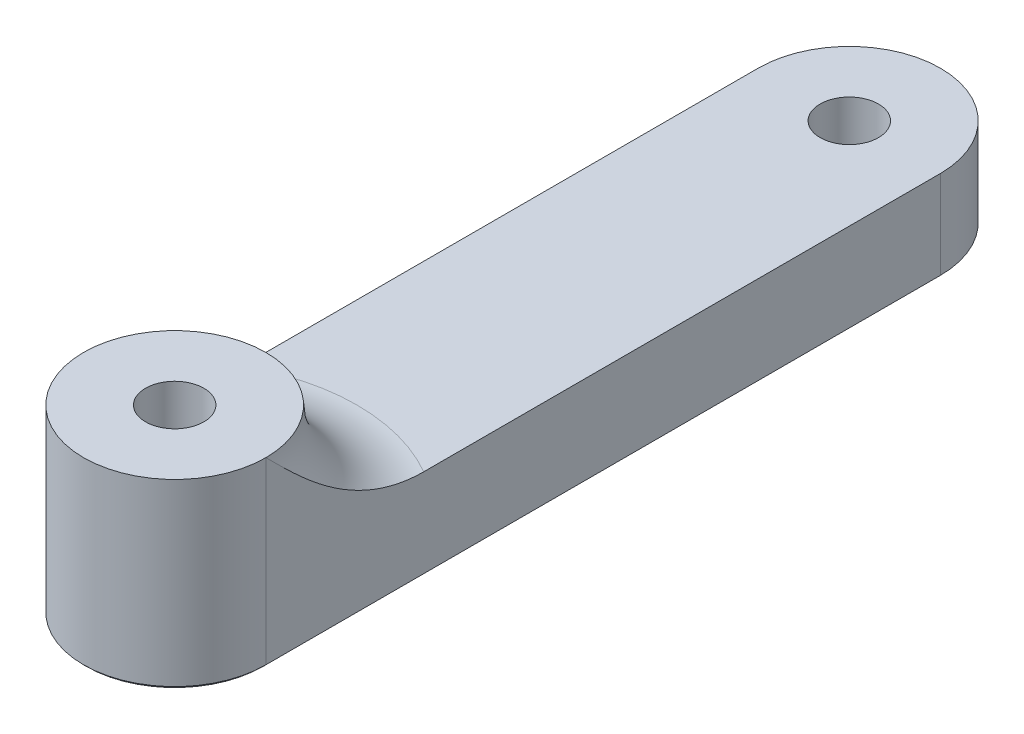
ISO-10303-21;
HEADER;
FILE_DESCRIPTION(('STEP AP214'),'2;1');
FILE_NAME('part.step','',(''),(''),'','','');
FILE_SCHEMA(('AUTOMOTIVE_DESIGN { 1 0 10303 214 1 1 1 1 }'));
ENDSEC;
DATA;
#1=APPLICATION_CONTEXT('core data for automotive mechanical design processes');
#2=APPLICATION_PROTOCOL_DEFINITION('international standard','automotive_design',2000,#1);
#3=PRODUCT_CONTEXT('',#1,'mechanical');
#4=PRODUCT('Part','Part','',(#3));
#5=PRODUCT_RELATED_PRODUCT_CATEGORY('part','',(#4));
#6=PRODUCT_DEFINITION_FORMATION('','',#4);
#7=PRODUCT_DEFINITION_CONTEXT('part definition',#1,'design');
#8=PRODUCT_DEFINITION('design','',#6,#7);
#9=PRODUCT_DEFINITION_SHAPE('','',#8);
#10=(LENGTH_UNIT() NAMED_UNIT(*) SI_UNIT(.MILLI.,.METRE.));
#11=(NAMED_UNIT(*) PLANE_ANGLE_UNIT() SI_UNIT($,.RADIAN.));
#12=(NAMED_UNIT(*) SI_UNIT($,.STERADIAN.) SOLID_ANGLE_UNIT());
#13=UNCERTAINTY_MEASURE_WITH_UNIT(LENGTH_MEASURE(1.E-05),#10,'distance_accuracy_value','');
#14=(GEOMETRIC_REPRESENTATION_CONTEXT(3) GLOBAL_UNCERTAINTY_ASSIGNED_CONTEXT((#13)) GLOBAL_UNIT_ASSIGNED_CONTEXT((#10,
#11,#12)) REPRESENTATION_CONTEXT('',''));
#15=CARTESIAN_POINT('',(0.,0.,0.));
#16=DIRECTION('',(0.,0.,1.));
#17=DIRECTION('',(1.,0.,0.));
#18=AXIS2_PLACEMENT_3D('',#15,#16,#17);
#19=CARTESIAN_POINT('',(5.,5.,0.));
#20=DIRECTION('',(-1.,0.,0.));
#21=DIRECTION('',(0.,0.,1.));
#22=AXIS2_PLACEMENT_3D('',#19,#20,#21);
#23=PLANE('',#22);
#24=DIRECTION('',(0.,-1.,0.));
#25=VECTOR('',#24,1.);
#26=CARTESIAN_POINT('',(5.,5.,0.));
#27=LINE('',#26,#25);
#28=CARTESIAN_POINT('',(5.,10.,0.));
#29=VERTEX_POINT('',#28);
#30=CARTESIAN_POINT('',(5.,0.16,0.));
#31=VERTEX_POINT('',#30);
#32=EDGE_CURVE('E136',#29,#31,#27,.T.);
#33=ORIENTED_EDGE('',*,*,#32,.T.);
#34=DIRECTION('',(0.,0.,-1.));
#35=VECTOR('',#34,1.);
#36=CARTESIAN_POINT('',(5.,0.16,0.));
#37=LINE('',#36,#35);
#38=CARTESIAN_POINT('',(5.,0.16,-37.));
#39=VERTEX_POINT('',#38);
#40=EDGE_CURVE('E134',#31,#39,#37,.T.);
#41=ORIENTED_EDGE('',*,*,#40,.T.);
#42=DIRECTION('',(0.,-1.,0.));
#43=VECTOR('',#42,1.);
#44=CARTESIAN_POINT('',(5.,5.,-37.));
#45=LINE('',#44,#43);
#46=CARTESIAN_POINT('',(5.,5.,-37.));
#47=VERTEX_POINT('',#46);
#48=EDGE_CURVE('E125',#47,#39,#45,.T.);
#49=ORIENTED_EDGE('',*,*,#48,.F.);
#50=DIRECTION('',(0.,0.,-1.));
#51=VECTOR('',#50,1.);
#52=CARTESIAN_POINT('',(5.,5.,0.));
#53=LINE('',#52,#51);
#54=CARTESIAN_POINT('',(5.,5.,-8.66025403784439));
#55=VERTEX_POINT('',#54);
#56=EDGE_CURVE('E110',#55,#47,#53,.T.);
#57=ORIENTED_EDGE('',*,*,#56,.F.);
#58=CARTESIAN_POINT('',(5.,5.,-8.66025403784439));
#59=CARTESIAN_POINT('',(5.,4.99997030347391,-8.44601573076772));
#60=CARTESIAN_POINT('',(5.,5.01032231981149,-8.23190253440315));
#61=CARTESIAN_POINT('',(5.,5.050367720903,-7.80580224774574));
#62=CARTESIAN_POINT('',(5.,5.08003167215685,-7.59381241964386));
#63=CARTESIAN_POINT('',(5.,5.15682193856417,-7.1757075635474));
#64=CARTESIAN_POINT('',(5.,5.20373357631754,-6.96955252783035));
#65=CARTESIAN_POINT('',(5.,5.31359736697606,-6.56149704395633));
#66=CARTESIAN_POINT('',(5.,5.37655718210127,-6.35959867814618));
#67=CARTESIAN_POINT('',(5.,5.54314037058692,-5.88676408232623));
#68=CARTESIAN_POINT('',(5.,5.65317829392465,-5.61808083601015));
#69=CARTESIAN_POINT('',(5.,5.89668641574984,-5.09159904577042));
#70=CARTESIAN_POINT('',(5.,6.03016371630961,-4.83380383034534));
#71=CARTESIAN_POINT('',(5.,6.31742397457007,-4.32824469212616));
#72=CARTESIAN_POINT('',(5.,6.47130085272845,-4.08053454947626));
#73=CARTESIAN_POINT('',(5.,6.7953125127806,-3.59591179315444));
#74=CARTESIAN_POINT('',(5.,6.96545472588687,-3.3590041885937));
#75=CARTESIAN_POINT('',(5.,7.56870777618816,-2.56650316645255));
#76=CARTESIAN_POINT('',(5.,8.03294068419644,-2.0348194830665));
#77=CARTESIAN_POINT('',(5.,8.99476039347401,-1.00542089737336));
#78=CARTESIAN_POINT('',(5.,9.49232114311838,-0.507680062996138));
#79=CARTESIAN_POINT('',(5.,9.99333333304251,-0.00666666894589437));
#80=CARTESIAN_POINT('',(5.,9.99666666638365,-0.00333333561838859));
#81=CARTESIAN_POINT('',(5.,10.,0.));
#82=B_SPLINE_CURVE_WITH_KNOTS('',3,(#58,#59,#60,#61,#62,#63,#64,#65,#66,#67,#68,#69,#70,#71,#72,
#73,#74,#75,#76,#77,#78,#79,#80,#81),.UNSPECIFIED.,.F.,.F.,(4,2,2,2,2,2,2,2,2,2,2,4),(0.,
0.642281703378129,1.28358678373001,1.91716595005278,2.55104818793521,3.42069998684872,
4.29061574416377,5.16468554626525,6.03915661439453,8.15226547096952,10.2637414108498,
10.2778835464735),.UNSPECIFIED.);
#83=EDGE_CURVE('E11',#55,#29,#82,.T.);
#84=ORIENTED_EDGE('',*,*,#83,.T.);
#85=EDGE_LOOP('',(#33,#41,#49,#57,#84));
#86=FACE_BOUND('',#85,.T.);
#87=ADVANCED_FACE('F47',(#86),#23,.F.);
#88=CARTESIAN_POINT('',(0.,5.,-37.));
#89=DIRECTION('',(0.,-1.,0.));
#90=DIRECTION('',(0.,0.,-1.));
#91=AXIS2_PLACEMENT_3D('',#88,#89,#90);
#92=CYLINDRICAL_SURFACE('',#91,5.);
#93=ORIENTED_EDGE('',*,*,#48,.T.);
#94=CARTESIAN_POINT('',(0.,0.16,-37.));
#95=DIRECTION('',(0.,1.,0.));
#96=DIRECTION('',(0.,0.,1.));
#97=AXIS2_PLACEMENT_3D('',#94,#95,#96);
#98=CIRCLE('',#97,5.);
#99=CARTESIAN_POINT('',(-5.,0.16,-37.));
#100=VERTEX_POINT('',#99);
#101=EDGE_CURVE('E170',#39,#100,#98,.T.);
#102=ORIENTED_EDGE('',*,*,#101,.T.);
#103=DIRECTION('',(0.,-1.,0.));
#104=VECTOR('',#103,1.);
#105=CARTESIAN_POINT('',(-5.,5.,-37.));
#106=LINE('',#105,#104);
#107=CARTESIAN_POINT('',(-5.,5.,-37.));
#108=VERTEX_POINT('',#107);
#109=EDGE_CURVE('E128',#108,#100,#106,.T.);
#110=ORIENTED_EDGE('',*,*,#109,.F.);
#111=CARTESIAN_POINT('',(0.,5.,-37.));
#112=DIRECTION('',(0.,1.,0.));
#113=DIRECTION('',(0.,0.,1.));
#114=AXIS2_PLACEMENT_3D('',#111,#112,#113);
#115=CIRCLE('',#114,5.);
#116=EDGE_CURVE('E113',#47,#108,#115,.T.);
#117=ORIENTED_EDGE('',*,*,#116,.F.);
#118=EDGE_LOOP('',(#93,#102,#110,#117));
#119=FACE_BOUND('',#118,.T.);
#120=ADVANCED_FACE('F123',(#119),#92,.T.);
#121=CARTESIAN_POINT('',(0.,5.,-37.));
#122=DIRECTION('',(0.,-1.,0.));
#123=DIRECTION('',(0.,0.,-1.));
#124=AXIS2_PLACEMENT_3D('',#121,#122,#123);
#125=CYLINDRICAL_SURFACE('',#124,1.6);
#126=CARTESIAN_POINT('',(0.,0.160000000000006,-37.));
#127=DIRECTION('',(0.,1.,0.));
#128=DIRECTION('',(0.,0.,1.));
#129=AXIS2_PLACEMENT_3D('',#126,#127,#128);
#130=CIRCLE('',#129,1.6);
#131=CARTESIAN_POINT('',(0.,0.160000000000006,-35.4));
#132=VERTEX_POINT('',#131);
#133=EDGE_CURVE('E181',#132,#132,#130,.F.);
#134=ORIENTED_EDGE('',*,*,#133,.T.);
#135=EDGE_LOOP('',(#134));
#136=FACE_BOUND('',#135,.T.);
#137=CARTESIAN_POINT('',(0.,5.,-37.));
#138=DIRECTION('',(0.,1.,0.));
#139=DIRECTION('',(0.,0.,1.));
#140=AXIS2_PLACEMENT_3D('',#137,#138,#139);
#141=CIRCLE('',#140,1.6);
#142=CARTESIAN_POINT('',(0.,5.,-35.4));
#143=VERTEX_POINT('',#142);
#144=EDGE_CURVE('E119',#143,#143,#141,.T.);
#145=ORIENTED_EDGE('',*,*,#144,.T.);
#146=EDGE_LOOP('',(#145));
#147=FACE_BOUND('',#146,.T.);
#148=ADVANCED_FACE('F212',(#136,#147),#125,.F.);
#149=CARTESIAN_POINT('',(-5.,5.,0.));
#150=DIRECTION('',(-1.,0.,0.));
#151=DIRECTION('',(0.,0.,1.));
#152=AXIS2_PLACEMENT_3D('',#149,#150,#151);
#153=PLANE('',#152);
#154=ORIENTED_EDGE('',*,*,#109,.T.);
#155=DIRECTION('',(0.,0.,1.));
#156=VECTOR('',#155,1.);
#157=CARTESIAN_POINT('',(-5.,0.16,0.));
#158=LINE('',#157,#156);
#159=CARTESIAN_POINT('',(-5.,0.16,0.));
#160=VERTEX_POINT('',#159);
#161=EDGE_CURVE('E173',#100,#160,#158,.T.);
#162=ORIENTED_EDGE('',*,*,#161,.T.);
#163=DIRECTION('',(0.,-1.,0.));
#164=VECTOR('',#163,1.);
#165=CARTESIAN_POINT('',(-5.,5.,0.));
#166=LINE('',#165,#164);
#167=CARTESIAN_POINT('',(-5.,10.,0.));
#168=VERTEX_POINT('',#167);
#169=EDGE_CURVE('E142',#168,#160,#166,.T.);
#170=ORIENTED_EDGE('',*,*,#169,.F.);
#171=CARTESIAN_POINT('',(-5.,5.,-8.66025403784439));
#172=CARTESIAN_POINT('',(-5.,4.99997030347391,-8.44601573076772));
#173=CARTESIAN_POINT('',(-5.,5.01032231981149,-8.23190253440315));
#174=CARTESIAN_POINT('',(-5.,5.050367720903,-7.80580224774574));
#175=CARTESIAN_POINT('',(-5.,5.08003167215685,-7.59381241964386));
#176=CARTESIAN_POINT('',(-5.,5.15682193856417,-7.1757075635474));
#177=CARTESIAN_POINT('',(-5.,5.20373357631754,-6.96955252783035));
#178=CARTESIAN_POINT('',(-5.,5.31359736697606,-6.56149704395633));
#179=CARTESIAN_POINT('',(-5.,5.37655718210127,-6.35959867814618));
#180=CARTESIAN_POINT('',(-5.,5.54314037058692,-5.88676408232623));
#181=CARTESIAN_POINT('',(-5.,5.65317829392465,-5.61808083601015));
#182=CARTESIAN_POINT('',(-5.,5.89668641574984,-5.09159904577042));
#183=CARTESIAN_POINT('',(-5.,6.03016371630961,-4.83380383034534));
#184=CARTESIAN_POINT('',(-5.,6.31742397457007,-4.32824469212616));
#185=CARTESIAN_POINT('',(-5.,6.47130085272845,-4.08053454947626));
#186=CARTESIAN_POINT('',(-5.,6.7953125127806,-3.59591179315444));
#187=CARTESIAN_POINT('',(-5.,6.96545472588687,-3.3590041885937));
#188=CARTESIAN_POINT('',(-5.,7.56870777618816,-2.56650316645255));
#189=CARTESIAN_POINT('',(-5.,8.03294068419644,-2.0348194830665));
#190=CARTESIAN_POINT('',(-5.,8.99476039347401,-1.00542089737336));
#191=CARTESIAN_POINT('',(-5.,9.49232114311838,-0.507680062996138));
#192=CARTESIAN_POINT('',(-5.,9.99333333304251,-0.00666666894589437));
#193=CARTESIAN_POINT('',(-5.,9.99666666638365,-0.00333333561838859));
#194=CARTESIAN_POINT('',(-5.,10.,0.));
#195=B_SPLINE_CURVE_WITH_KNOTS('',3,(#171,#172,#173,#174,#175,#176,#177,#178,#179,#180,#181,
#182,#183,#184,#185,#186,#187,#188,#189,#190,#191,#192,#193,#194),.UNSPECIFIED.,.F.,.F.,(4,2,2,
2,2,2,2,2,2,2,2,4),(0.,0.642281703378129,1.28358678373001,1.91716595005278,2.55104818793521,
3.42069998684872,4.29061574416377,5.16468554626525,6.03915661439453,8.15226547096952,
10.2637414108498,10.2778835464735),.UNSPECIFIED.);
#196=CARTESIAN_POINT('',(-5.,5.,-8.66025403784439));
#197=VERTEX_POINT('',#196);
#198=EDGE_CURVE('E62',#168,#197,#195,.F.);
#199=ORIENTED_EDGE('',*,*,#198,.T.);
#200=DIRECTION('',(0.,0.,-1.));
#201=VECTOR('',#200,1.);
#202=CARTESIAN_POINT('',(-5.,5.,0.));
#203=LINE('',#202,#201);
#204=EDGE_CURVE('E130',#197,#108,#203,.T.);
#205=ORIENTED_EDGE('',*,*,#204,.T.);
#206=EDGE_LOOP('',(#154,#162,#170,#199,#205));
#207=FACE_BOUND('',#206,.T.);
#208=ADVANCED_FACE('F207',(#207),#153,.T.);
#209=CARTESIAN_POINT('',(0.,5.,0.));
#210=DIRECTION('',(0.,1.,0.));
#211=DIRECTION('',(0.,0.,1.));
#212=AXIS2_PLACEMENT_3D('',#209,#210,#211);
#213=PLANE('',#212);
#214=ORIENTED_EDGE('',*,*,#144,.F.);
#215=EDGE_LOOP('',(#214));
#216=FACE_BOUND('',#215,.T.);
#217=ORIENTED_EDGE('',*,*,#204,.F.);
#218=CARTESIAN_POINT('',(0.,5.,0.));
#219=DIRECTION('',(0.,1.,0.));
#220=DIRECTION('',(0.,0.,1.));
#221=AXIS2_PLACEMENT_3D('',#218,#219,#220);
#222=CIRCLE('',#221,10.);
#223=EDGE_CURVE('E75',#197,#55,#222,.F.);
#224=ORIENTED_EDGE('',*,*,#223,.T.);
#225=ORIENTED_EDGE('',*,*,#56,.T.);
#226=ORIENTED_EDGE('',*,*,#116,.T.);
#227=EDGE_LOOP('',(#217,#224,#225,#226));
#228=FACE_BOUND('',#227,.T.);
#229=ADVANCED_FACE('F112',(#216,#228),#213,.T.);
#230=CARTESIAN_POINT('',(0.,0.,0.));
#231=DIRECTION('',(0.,1.,0.));
#232=DIRECTION('',(0.,0.,1.));
#233=AXIS2_PLACEMENT_3D('',#230,#231,#232);
#234=PLANE('',#233);
#235=CARTESIAN_POINT('',(0.,0.,0.));
#236=DIRECTION('',(0.,1.,0.));
#237=DIRECTION('',(0.,0.,1.));
#238=AXIS2_PLACEMENT_3D('',#235,#236,#237);
#239=CIRCLE('',#238,1.76);
#240=CARTESIAN_POINT('',(0.,0.,1.76));
#241=VERTEX_POINT('',#240);
#242=EDGE_CURVE('E162',#241,#241,#239,.T.);
#243=ORIENTED_EDGE('',*,*,#242,.T.);
#244=EDGE_LOOP('',(#243));
#245=FACE_BOUND('',#244,.T.);
#246=DIRECTION('',(0.,0.,-1.));
#247=VECTOR('',#246,1.);
#248=CARTESIAN_POINT('',(-4.84,0.,-37.));
#249=LINE('',#248,#247);
#250=CARTESIAN_POINT('',(-4.84,0.,0.));
#251=VERTEX_POINT('',#250);
#252=CARTESIAN_POINT('',(-4.84,0.,-37.));
#253=VERTEX_POINT('',#252);
#254=EDGE_CURVE('E155',#251,#253,#249,.T.);
#255=ORIENTED_EDGE('',*,*,#254,.T.);
#256=CARTESIAN_POINT('',(0.,0.,-37.));
#257=DIRECTION('',(0.,1.,0.));
#258=DIRECTION('',(0.,0.,1.));
#259=AXIS2_PLACEMENT_3D('',#256,#257,#258);
#260=CIRCLE('',#259,4.84);
#261=CARTESIAN_POINT('',(4.84,0.,-37.));
#262=VERTEX_POINT('',#261);
#263=EDGE_CURVE('E158',#253,#262,#260,.F.);
#264=ORIENTED_EDGE('',*,*,#263,.T.);
#265=DIRECTION('',(0.,0.,1.));
#266=VECTOR('',#265,1.);
#267=CARTESIAN_POINT('',(4.84,0.,0.));
#268=LINE('',#267,#266);
#269=CARTESIAN_POINT('',(4.84,0.,0.));
#270=VERTEX_POINT('',#269);
#271=EDGE_CURVE('E149',#262,#270,#268,.T.);
#272=ORIENTED_EDGE('',*,*,#271,.T.);
#273=CARTESIAN_POINT('',(0.,0.,0.));
#274=DIRECTION('',(0.,1.,0.));
#275=DIRECTION('',(0.,0.,1.));
#276=AXIS2_PLACEMENT_3D('',#273,#274,#275);
#277=CIRCLE('',#276,4.84);
#278=EDGE_CURVE('E152',#270,#251,#277,.F.);
#279=ORIENTED_EDGE('',*,*,#278,.T.);
#280=EDGE_LOOP('',(#255,#264,#272,#279));
#281=FACE_BOUND('',#280,.T.);
#282=CARTESIAN_POINT('',(0.,0.,-37.));
#283=DIRECTION('',(0.,1.,0.));
#284=DIRECTION('',(0.,0.,1.));
#285=AXIS2_PLACEMENT_3D('',#282,#283,#284);
#286=CIRCLE('',#285,1.76);
#287=CARTESIAN_POINT('',(0.,0.,-35.24));
#288=VERTEX_POINT('',#287);
#289=EDGE_CURVE('E140',#288,#288,#286,.T.);
#290=ORIENTED_EDGE('',*,*,#289,.T.);
#291=EDGE_LOOP('',(#290));
#292=FACE_BOUND('',#291,.T.);
#293=ADVANCED_FACE('F213',(#245,#281,#292),#234,.F.);
#294=CARTESIAN_POINT('',(0.,10.,0.));
#295=DIRECTION('',(0.,-1.,0.));
#296=DIRECTION('',(0.,0.,-1.));
#297=AXIS2_PLACEMENT_3D('',#294,#295,#296);
#298=CYLINDRICAL_SURFACE('',#297,5.);
#299=CARTESIAN_POINT('',(0.,10.,0.));
#300=DIRECTION('',(0.,1.,0.));
#301=DIRECTION('',(0.,0.,1.));
#302=AXIS2_PLACEMENT_3D('',#299,#300,#301);
#303=CIRCLE('',#302,5.);
#304=EDGE_CURVE('E199',#168,#29,#303,.T.);
#305=ORIENTED_EDGE('',*,*,#304,.F.);
#306=ORIENTED_EDGE('',*,*,#169,.T.);
#307=CARTESIAN_POINT('',(0.,0.16,0.));
#308=DIRECTION('',(0.,1.,0.));
#309=DIRECTION('',(0.,0.,1.));
#310=AXIS2_PLACEMENT_3D('',#307,#308,#309);
#311=CIRCLE('',#310,5.);
#312=EDGE_CURVE('E176',#160,#31,#311,.T.);
#313=ORIENTED_EDGE('',*,*,#312,.T.);
#314=ORIENTED_EDGE('',*,*,#32,.F.);
#315=EDGE_LOOP('',(#305,#306,#313,#314));
#316=FACE_BOUND('',#315,.T.);
#317=ADVANCED_FACE('F272',(#316),#298,.T.);
#318=CARTESIAN_POINT('',(0.,10.,0.));
#319=DIRECTION('',(0.,-1.,0.));
#320=DIRECTION('',(0.,0.,-1.));
#321=AXIS2_PLACEMENT_3D('',#318,#319,#320);
#322=CYLINDRICAL_SURFACE('',#321,1.6);
#323=CARTESIAN_POINT('',(0.,0.15999999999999,0.));
#324=DIRECTION('',(0.,1.,0.));
#325=DIRECTION('',(0.,0.,1.));
#326=AXIS2_PLACEMENT_3D('',#323,#324,#325);
#327=CIRCLE('',#326,1.6);
#328=CARTESIAN_POINT('',(0.,0.15999999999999,1.6));
#329=VERTEX_POINT('',#328);
#330=EDGE_CURVE('E166',#329,#329,#327,.F.);
#331=ORIENTED_EDGE('',*,*,#330,.T.);
#332=EDGE_LOOP('',(#331));
#333=FACE_BOUND('',#332,.T.);
#334=CARTESIAN_POINT('',(0.,10.,0.));
#335=DIRECTION('',(0.,1.,0.));
#336=DIRECTION('',(0.,0.,1.));
#337=AXIS2_PLACEMENT_3D('',#334,#335,#336);
#338=CIRCLE('',#337,1.6);
#339=CARTESIAN_POINT('',(0.,10.,1.6));
#340=VERTEX_POINT('',#339);
#341=EDGE_CURVE('E300',#340,#340,#338,.T.);
#342=ORIENTED_EDGE('',*,*,#341,.T.);
#343=EDGE_LOOP('',(#342));
#344=FACE_BOUND('',#343,.T.);
#345=ADVANCED_FACE('F278',(#333,#344),#322,.F.);
#346=CARTESIAN_POINT('',(0.,10.,0.));
#347=DIRECTION('',(0.,1.,0.));
#348=DIRECTION('',(0.,0.,1.));
#349=AXIS2_PLACEMENT_3D('',#346,#347,#348);
#350=PLANE('',#349);
#351=EDGE_CURVE('E304',#29,#168,#303,.T.);
#352=ORIENTED_EDGE('',*,*,#351,.T.);
#353=ORIENTED_EDGE('',*,*,#304,.T.);
#354=EDGE_LOOP('',(#352,#353));
#355=FACE_BOUND('',#354,.T.);
#356=ORIENTED_EDGE('',*,*,#341,.F.);
#357=EDGE_LOOP('',(#356));
#358=FACE_BOUND('',#357,.T.);
#359=ADVANCED_FACE('F230',(#355,#358),#350,.T.);
#360=CARTESIAN_POINT('',(0.,0.,0.));
#361=DIRECTION('',(0.,-1.,0.));
#362=DIRECTION('',(0.,0.,-1.));
#363=AXIS2_PLACEMENT_3D('',#360,#361,#362);
#364=CONICAL_SURFACE('',#363,1.76,0.785398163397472);
#365=ORIENTED_EDGE('',*,*,#330,.F.);
#366=EDGE_LOOP('',(#365));
#367=FACE_BOUND('',#366,.T.);
#368=ORIENTED_EDGE('',*,*,#242,.F.);
#369=EDGE_LOOP('',(#368));
#370=FACE_BOUND('',#369,.T.);
#371=ADVANCED_FACE('F223',(#367,#370),#364,.F.);
#372=CARTESIAN_POINT('',(0.,0.16,0.));
#373=DIRECTION('',(0.,1.,0.));
#374=DIRECTION('',(0.,0.,1.));
#375=AXIS2_PLACEMENT_3D('',#372,#373,#374);
#376=CONICAL_SURFACE('',#375,5.,0.785398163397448);
#377=DIRECTION('',(-0.707106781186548,0.707106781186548,0.));
#378=VECTOR('',#377,1.);
#379=CARTESIAN_POINT('',(-4.84,0.,0.));
#380=LINE('',#379,#378);
#381=EDGE_CURVE('E191',#251,#160,#380,.T.);
#382=ORIENTED_EDGE('',*,*,#381,.F.);
#383=ORIENTED_EDGE('',*,*,#278,.F.);
#384=DIRECTION('',(-0.707106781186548,-0.707106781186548,0.));
#385=VECTOR('',#384,1.);
#386=CARTESIAN_POINT('',(5.,0.16,0.));
#387=LINE('',#386,#385);
#388=EDGE_CURVE('E195',#31,#270,#387,.T.);
#389=ORIENTED_EDGE('',*,*,#388,.F.);
#390=ORIENTED_EDGE('',*,*,#312,.F.);
#391=EDGE_LOOP('',(#382,#383,#389,#390));
#392=FACE_BOUND('',#391,.T.);
#393=ADVANCED_FACE('F229',(#392),#376,.T.);
#394=CARTESIAN_POINT('',(5.,0.16,0.));
#395=DIRECTION('',(-0.707106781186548,0.707106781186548,0.));
#396=DIRECTION('',(0.,0.,-1.));
#397=AXIS2_PLACEMENT_3D('',#394,#395,#396);
#398=PLANE('',#397);
#399=ORIENTED_EDGE('',*,*,#388,.T.);
#400=ORIENTED_EDGE('',*,*,#271,.F.);
#401=DIRECTION('',(-0.707106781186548,-0.707106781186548,0.));
#402=VECTOR('',#401,1.);
#403=CARTESIAN_POINT('',(5.,0.16,-37.));
#404=LINE('',#403,#402);
#405=EDGE_CURVE('E188',#39,#262,#404,.T.);
#406=ORIENTED_EDGE('',*,*,#405,.F.);
#407=ORIENTED_EDGE('',*,*,#40,.F.);
#408=EDGE_LOOP('',(#399,#400,#406,#407));
#409=FACE_BOUND('',#408,.T.);
#410=ADVANCED_FACE('F248',(#409),#398,.F.);
#411=CARTESIAN_POINT('',(-4.84,0.,0.));
#412=DIRECTION('',(-0.707106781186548,-0.707106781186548,0.));
#413=DIRECTION('',(0.,0.,1.));
#414=AXIS2_PLACEMENT_3D('',#411,#412,#413);
#415=PLANE('',#414);
#416=ORIENTED_EDGE('',*,*,#381,.T.);
#417=ORIENTED_EDGE('',*,*,#161,.F.);
#418=DIRECTION('',(-0.707106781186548,0.707106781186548,0.));
#419=VECTOR('',#418,1.);
#420=CARTESIAN_POINT('',(-4.84,0.,-37.));
#421=LINE('',#420,#419);
#422=EDGE_CURVE('E185',#253,#100,#421,.T.);
#423=ORIENTED_EDGE('',*,*,#422,.F.);
#424=ORIENTED_EDGE('',*,*,#254,.F.);
#425=EDGE_LOOP('',(#416,#417,#423,#424));
#426=FACE_BOUND('',#425,.T.);
#427=ADVANCED_FACE('F241',(#426),#415,.T.);
#428=CARTESIAN_POINT('',(0.,0.16,-37.));
#429=DIRECTION('',(0.,1.,0.));
#430=DIRECTION('',(0.,0.,1.));
#431=AXIS2_PLACEMENT_3D('',#428,#429,#430);
#432=CONICAL_SURFACE('',#431,5.,0.785398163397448);
#433=ORIENTED_EDGE('',*,*,#405,.T.);
#434=ORIENTED_EDGE('',*,*,#263,.F.);
#435=ORIENTED_EDGE('',*,*,#422,.T.);
#436=ORIENTED_EDGE('',*,*,#101,.F.);
#437=EDGE_LOOP('',(#433,#434,#435,#436));
#438=FACE_BOUND('',#437,.T.);
#439=ADVANCED_FACE('F233',(#438),#432,.T.);
#440=CARTESIAN_POINT('',(0.,0.,-37.));
#441=DIRECTION('',(0.,-1.,0.));
#442=DIRECTION('',(0.,0.,-1.));
#443=AXIS2_PLACEMENT_3D('',#440,#441,#442);
#444=CONICAL_SURFACE('',#443,1.76,0.785398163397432);
#445=ORIENTED_EDGE('',*,*,#133,.F.);
#446=EDGE_LOOP('',(#445));
#447=FACE_BOUND('',#446,.T.);
#448=ORIENTED_EDGE('',*,*,#289,.F.);
#449=EDGE_LOOP('',(#448));
#450=FACE_BOUND('',#449,.T.);
#451=ADVANCED_FACE('F240',(#447,#450),#444,.F.);
#452=CARTESIAN_POINT('',(0.,10.,0.));
#453=DIRECTION('',(0.,1.,0.));
#454=DIRECTION('',(0.,0.,1.));
#455=AXIS2_PLACEMENT_3D('',#452,#453,#454);
#456=TOROIDAL_SURFACE('',#455,10.,5.);
#457=ORIENTED_EDGE('',*,*,#83,.F.);
#458=ORIENTED_EDGE('',*,*,#223,.F.);
#459=ORIENTED_EDGE('',*,*,#198,.F.);
#460=ORIENTED_EDGE('',*,*,#351,.F.);
#461=EDGE_LOOP('',(#457,#458,#459,#460));
#462=FACE_BOUND('',#461,.T.);
#463=ADVANCED_FACE('F49',(#462),#456,.F.);
#464=CLOSED_SHELL('',(#87,#120,#148,#208,#229,#293,#317,#345,#359,#371,#393,#410,#427,#439,#451,#463));
#465=MANIFOLD_SOLID_BREP('B2',#464);
#466=ADVANCED_BREP_SHAPE_REPRESENTATION('',(#18,#465),#14);
#467=SHAPE_DEFINITION_REPRESENTATION(#9,#466);
ENDSEC;
END-ISO-10303-21;
